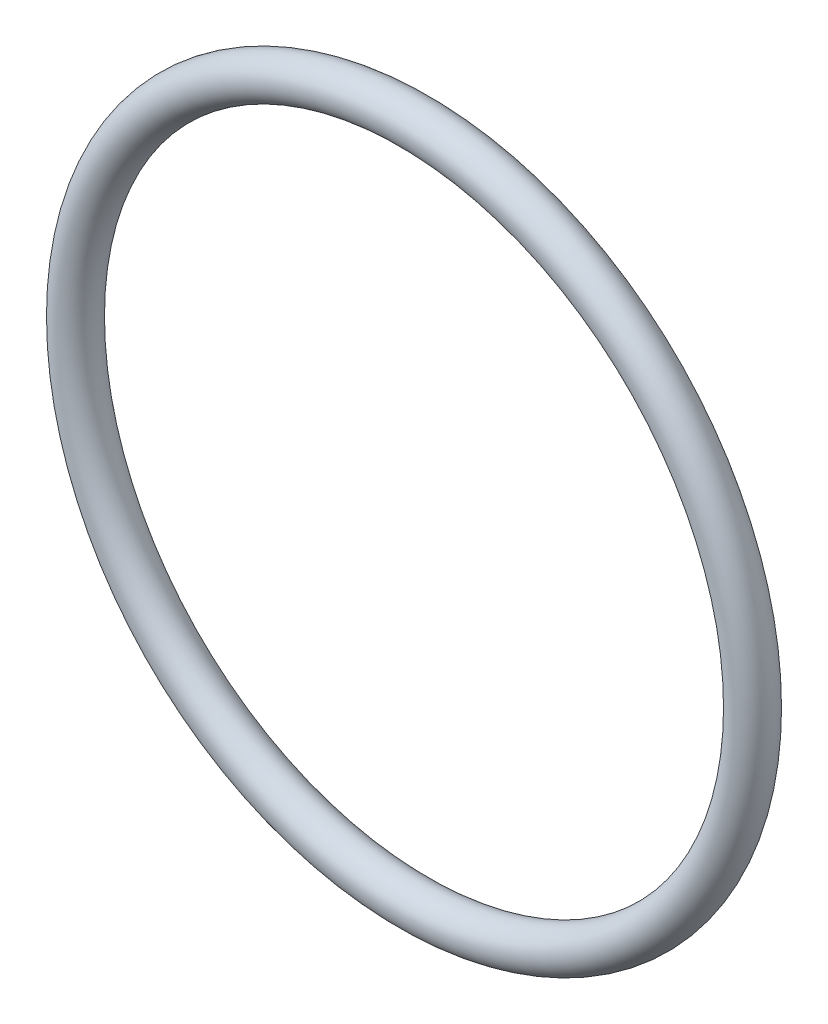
ISO-10303-21;
HEADER;
FILE_DESCRIPTION(('STEP AP214'),'2;1');
FILE_NAME('part.step','',(''),(''),'','','');
FILE_SCHEMA(('AUTOMOTIVE_DESIGN { 1 0 10303 214 1 1 1 1 }'));
ENDSEC;
DATA;
#1=APPLICATION_CONTEXT('core data for automotive mechanical design processes');
#2=APPLICATION_PROTOCOL_DEFINITION('international standard','automotive_design',2000,#1);
#3=PRODUCT_CONTEXT('',#1,'mechanical');
#4=PRODUCT('Part','Part','',(#3));
#5=PRODUCT_RELATED_PRODUCT_CATEGORY('part','',(#4));
#6=PRODUCT_DEFINITION_FORMATION('','',#4);
#7=PRODUCT_DEFINITION_CONTEXT('part definition',#1,'design');
#8=PRODUCT_DEFINITION('design','',#6,#7);
#9=PRODUCT_DEFINITION_SHAPE('','',#8);
#10=(LENGTH_UNIT() NAMED_UNIT(*) SI_UNIT(.MILLI.,.METRE.));
#11=(NAMED_UNIT(*) PLANE_ANGLE_UNIT() SI_UNIT($,.RADIAN.));
#12=(NAMED_UNIT(*) SI_UNIT($,.STERADIAN.) SOLID_ANGLE_UNIT());
#13=UNCERTAINTY_MEASURE_WITH_UNIT(LENGTH_MEASURE(1.E-05),#10,'distance_accuracy_value','');
#14=(GEOMETRIC_REPRESENTATION_CONTEXT(3) GLOBAL_UNCERTAINTY_ASSIGNED_CONTEXT((#13)) GLOBAL_UNIT_ASSIGNED_CONTEXT((#10,
#11,#12)) REPRESENTATION_CONTEXT('',''));
#15=CARTESIAN_POINT('',(0.,0.,0.));
#16=DIRECTION('',(0.,0.,1.));
#17=DIRECTION('',(1.,0.,0.));
#18=AXIS2_PLACEMENT_3D('',#15,#16,#17);
#19=CARTESIAN_POINT('',(0.,31.6701550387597,-1.35878552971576));
#20=DIRECTION('',(0.,0.,1.));
#21=DIRECTION('',(1.,0.,0.));
#22=AXIS2_PLACEMENT_3D('',#19,#20,#21);
#23=TOROIDAL_SURFACE('',#22,16.5,1.);
#24=CARTESIAN_POINT('',(17.5,31.6701550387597,-1.35878552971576));
#25=VERTEX_POINT('',#24);
#26=VERTEX_LOOP('',#25);
#27=FACE_BOUND('',#26,.T.);
#28=ADVANCED_FACE('F27',(#27),#23,.T.);
#29=CLOSED_SHELL('',(#28));
#30=MANIFOLD_SOLID_BREP('B2',#29);
#31=ADVANCED_BREP_SHAPE_REPRESENTATION('',(#18,#30),#14);
#32=SHAPE_DEFINITION_REPRESENTATION(#9,#31);
ENDSEC;
END-ISO-10303-21;
